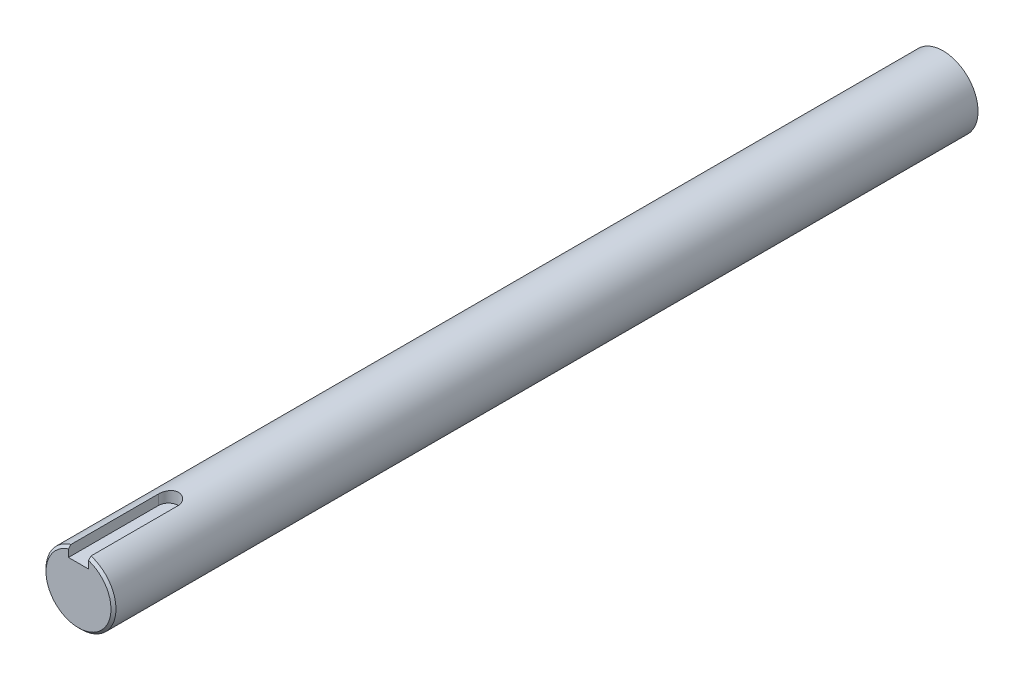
ISO-10303-21;
HEADER;
FILE_DESCRIPTION(('STEP AP214'),'2;1');
FILE_NAME('part.step','',(''),(''),'','','');
FILE_SCHEMA(('AUTOMOTIVE_DESIGN { 1 0 10303 214 1 1 1 1 }'));
ENDSEC;
DATA;
#1=APPLICATION_CONTEXT('core data for automotive mechanical design processes');
#2=APPLICATION_PROTOCOL_DEFINITION('international standard','automotive_design',2000,#1);
#3=PRODUCT_CONTEXT('',#1,'mechanical');
#4=PRODUCT('Part','Part','',(#3));
#5=PRODUCT_RELATED_PRODUCT_CATEGORY('part','',(#4));
#6=PRODUCT_DEFINITION_FORMATION('','',#4);
#7=PRODUCT_DEFINITION_CONTEXT('part definition',#1,'design');
#8=PRODUCT_DEFINITION('design','',#6,#7);
#9=PRODUCT_DEFINITION_SHAPE('','',#8);
#10=(LENGTH_UNIT() NAMED_UNIT(*) SI_UNIT(.MILLI.,.METRE.));
#11=(NAMED_UNIT(*) PLANE_ANGLE_UNIT() SI_UNIT($,.RADIAN.));
#12=(NAMED_UNIT(*) SI_UNIT($,.STERADIAN.) SOLID_ANGLE_UNIT());
#13=UNCERTAINTY_MEASURE_WITH_UNIT(LENGTH_MEASURE(1.E-05),#10,'distance_accuracy_value','');
#14=(GEOMETRIC_REPRESENTATION_CONTEXT(3) GLOBAL_UNCERTAINTY_ASSIGNED_CONTEXT((#13)) GLOBAL_UNIT_ASSIGNED_CONTEXT((#10,
#11,#12)) REPRESENTATION_CONTEXT('',''));
#15=CARTESIAN_POINT('',(0.,0.,0.));
#16=DIRECTION('',(0.,0.,1.));
#17=DIRECTION('',(1.,0.,0.));
#18=AXIS2_PLACEMENT_3D('',#15,#16,#17);
#19=CARTESIAN_POINT('',(0.,0.,98.));
#20=DIRECTION('',(0.,0.,-1.));
#21=DIRECTION('',(-1.,0.,0.));
#22=AXIS2_PLACEMENT_3D('',#19,#20,#21);
#23=CYLINDRICAL_SURFACE('',#22,7.);
#24=DIRECTION('',(0.,0.,-1.));
#25=VECTOR('',#24,1.);
#26=CARTESIAN_POINT('',(2.,6.70820393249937,98.));
#27=LINE('',#26,#25);
#28=CARTESIAN_POINT('',(2.,6.70820393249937,97.5));
#29=VERTEX_POINT('',#28);
#30=CARTESIAN_POINT('',(2.,6.70820393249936,80.));
#31=VERTEX_POINT('',#30);
#32=EDGE_CURVE('E103',#29,#31,#27,.T.);
#33=ORIENTED_EDGE('',*,*,#32,.F.);
#34=CARTESIAN_POINT('',(0.,0.,97.5));
#35=DIRECTION('',(0.,0.,1.));
#36=DIRECTION('',(1.,0.,0.));
#37=AXIS2_PLACEMENT_3D('',#34,#35,#36);
#38=CIRCLE('',#37,7.);
#39=CARTESIAN_POINT('',(-2.,6.70820393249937,97.5));
#40=VERTEX_POINT('',#39);
#41=EDGE_CURVE('E48',#29,#40,#38,.F.);
#42=ORIENTED_EDGE('',*,*,#41,.T.);
#43=DIRECTION('',(0.,0.,-1.));
#44=VECTOR('',#43,1.);
#45=CARTESIAN_POINT('',(-2.,6.70820393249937,98.));
#46=LINE('',#45,#44);
#47=CARTESIAN_POINT('',(-2.,6.70820393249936,80.));
#48=VERTEX_POINT('',#47);
#49=EDGE_CURVE('E114',#40,#48,#46,.T.);
#50=ORIENTED_EDGE('',*,*,#49,.T.);
#51=CARTESIAN_POINT('',(2.,6.70820393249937,80.));
#52=CARTESIAN_POINT('',(2.00000099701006,6.70819953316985,79.9449659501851));
#53=CARTESIAN_POINT('',(1.99772698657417,6.70888204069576,79.8899594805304));
#54=CARTESIAN_POINT('',(1.988664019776,6.71157572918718,79.7803637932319));
#55=CARTESIAN_POINT('',(1.98187599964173,6.71358663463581,79.7257744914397));
#56=CARTESIAN_POINT('',(1.95485062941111,6.72152750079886,79.563492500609));
#57=CARTESIAN_POINT('',(1.92795143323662,6.72936619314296,79.4569243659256));
#58=CARTESIAN_POINT('',(1.85729763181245,6.74920530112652,79.2500599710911));
#59=CARTESIAN_POINT('',(1.81354760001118,6.76120458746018,79.1497620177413));
#60=CARTESIAN_POINT('',(1.7105009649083,6.78800504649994,78.9578633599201));
#61=CARTESIAN_POINT('',(1.65119805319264,6.80280735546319,78.8662662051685));
#62=CARTESIAN_POINT('',(1.51692637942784,6.83401742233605,78.6918092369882));
#63=CARTESIAN_POINT('',(1.44159286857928,6.85045675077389,78.6092358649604));
#64=CARTESIAN_POINT('',(1.27817556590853,6.88281888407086,78.4577009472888));
#65=CARTESIAN_POINT('',(1.19008966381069,6.89874160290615,78.3887416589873));
#66=CARTESIAN_POINT('',(1.00164390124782,6.92863365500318,78.2651698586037));
#67=CARTESIAN_POINT('',(0.901086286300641,6.94256116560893,78.210847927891));
#68=CARTESIAN_POINT('',(0.69180361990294,6.96652585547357,78.1199966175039));
#69=CARTESIAN_POINT('',(0.583080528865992,6.9765639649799,78.0834629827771));
#70=CARTESIAN_POINT('',(0.363559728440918,6.99139511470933,78.0301658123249));
#71=CARTESIAN_POINT('',(0.252890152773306,6.9963181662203,78.0129113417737));
#72=CARTESIAN_POINT('',(0.0301224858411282,7.0008209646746,77.9971132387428));
#73=CARTESIAN_POINT('',(-0.0819753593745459,7.00040161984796,77.9985664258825));
#74=CARTESIAN_POINT('',(-0.300980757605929,6.99436005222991,78.0198064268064));
#75=CARTESIAN_POINT('',(-0.40794465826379,6.98888865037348,78.0390618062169));
#76=CARTESIAN_POINT('',(-0.617053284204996,6.97353876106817,78.0944954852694));
#77=CARTESIAN_POINT('',(-0.719197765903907,6.96366005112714,78.1306746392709));
#78=CARTESIAN_POINT('',(-0.917074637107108,6.94039022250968,78.2193097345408));
#79=CARTESIAN_POINT('',(-1.01272458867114,6.92696183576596,78.2719395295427));
#80=CARTESIAN_POINT('',(-1.19400864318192,6.89802743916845,78.3918457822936));
#81=CARTESIAN_POINT('',(-1.27964070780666,6.88252100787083,78.4591252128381));
#82=CARTESIAN_POINT('',(-1.4416242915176,6.85045847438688,78.6091975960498));
#83=CARTESIAN_POINT('',(-1.51754611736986,6.83388462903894,78.6924510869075));
#84=CARTESIAN_POINT('',(-1.65448071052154,6.8020328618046,78.8706972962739));
#85=CARTESIAN_POINT('',(-1.71548924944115,6.78675530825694,78.9656933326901));
#86=CARTESIAN_POINT('',(-1.82126577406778,6.75914312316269,79.165787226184));
#87=CARTESIAN_POINT('',(-1.86589126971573,6.74683461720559,79.2709641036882));
#88=CARTESIAN_POINT('',(-1.93662306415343,6.72687625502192,79.4877120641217));
#89=CARTESIAN_POINT('',(-1.96275743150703,6.71921934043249,79.5992731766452));
#90=CARTESIAN_POINT('',(-1.98612021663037,6.71232934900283,79.7598794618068));
#91=CARTESIAN_POINT('',(-1.99132502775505,6.71078540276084,79.807779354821));
#92=CARTESIAN_POINT('',(-1.99826154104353,6.7087227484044,79.9037782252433));
#93=CARTESIAN_POINT('',(-1.99999854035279,6.70820247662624,79.9518767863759));
#94=CARTESIAN_POINT('',(-2.,6.70820393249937,80.));
#95=B_SPLINE_CURVE_WITH_KNOTS('',3,(#51,#52,#53,#54,#55,#56,#57,#58,#59,#60,#61,#62,#63,#64,#65,
#66,#67,#68,#69,#70,#71,#72,#73,#74,#75,#76,#77,#78,#79,#80,#81,#82,#83,#84,#85,#86,#87,#88,#89,
#90,#91,#92,#93,#94),.UNSPECIFIED.,.F.,.F.,(4,2,2,2,2,2,2,2,2,2,2,2,2,2,2,2,2,2,2,2,2,4),(0.,
0.164996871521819,0.32995953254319,0.658815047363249,0.987581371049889,1.3164812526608,
1.65386790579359,1.99131045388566,2.33502692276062,2.67866113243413,3.01332990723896,
3.34794178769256,3.67287650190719,3.99782762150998,4.32633613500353,4.65491137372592,
4.99498620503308,5.33515734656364,5.67822068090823,6.0207621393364,6.16526974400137,
6.30955644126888),.UNSPECIFIED.);
#96=EDGE_CURVE('E97',#31,#48,#95,.T.);
#97=ORIENTED_EDGE('',*,*,#96,.F.);
#98=EDGE_LOOP('',(#33,#42,#50,#97));
#99=FACE_BOUND('',#98,.T.);
#100=CARTESIAN_POINT('',(0.,0.,-75.));
#101=DIRECTION('',(0.,0.,-1.));
#102=DIRECTION('',(-1.,0.,0.));
#103=AXIS2_PLACEMENT_3D('',#100,#101,#102);
#104=CIRCLE('',#103,7.);
#105=CARTESIAN_POINT('',(-7.,0.,-75.));
#106=VERTEX_POINT('',#105);
#107=EDGE_CURVE('E98',#106,#106,#104,.T.);
#108=ORIENTED_EDGE('',*,*,#107,.F.);
#109=EDGE_LOOP('',(#108));
#110=FACE_BOUND('',#109,.T.);
#111=ADVANCED_FACE('F35',(#99,#110),#23,.T.);
#112=CARTESIAN_POINT('',(2.,4.7,98.));
#113=DIRECTION('',(1.,0.,0.));
#114=DIRECTION('',(0.,1.,0.));
#115=AXIS2_PLACEMENT_3D('',#112,#113,#114);
#116=PLANE('',#115);
#117=DIRECTION('',(0.,-1.,0.));
#118=VECTOR('',#117,1.);
#119=CARTESIAN_POINT('',(2.,4.7,98.));
#120=LINE('',#119,#118);
#121=CARTESIAN_POINT('',(2.,6.18465843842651,98.));
#122=VERTEX_POINT('',#121);
#123=CARTESIAN_POINT('',(2.,4.7,98.));
#124=VERTEX_POINT('',#123);
#125=EDGE_CURVE('E104',#122,#124,#120,.T.);
#126=ORIENTED_EDGE('',*,*,#125,.F.);
#127=CARTESIAN_POINT('',(2.,6.18465843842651,98.));
#128=CARTESIAN_POINT('',(2.,6.27206463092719,97.9168222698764));
#129=CARTESIAN_POINT('',(2.,6.35939651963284,97.8335667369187));
#130=CARTESIAN_POINT('',(2.,6.53391168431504,97.6669000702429));
#131=CARTESIAN_POINT('',(2.,6.62109496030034,97.583488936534));
#132=CARTESIAN_POINT('',(2.,6.70820393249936,97.5));
#133=B_SPLINE_CURVE_WITH_KNOTS('',3,(#127,#128,#129,#130,#131,#132),.UNSPECIFIED.,.F.,.F.,(4,2,
4),(0.,0.361973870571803,0.723947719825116),.UNSPECIFIED.);
#134=EDGE_CURVE('E62',#122,#29,#133,.T.);
#135=ORIENTED_EDGE('',*,*,#134,.T.);
#136=ORIENTED_EDGE('',*,*,#32,.T.);
#137=DIRECTION('',(0.,1.,0.));
#138=VECTOR('',#137,1.);
#139=CARTESIAN_POINT('',(2.,4.7,80.));
#140=LINE('',#139,#138);
#141=CARTESIAN_POINT('',(2.,4.7,80.));
#142=VERTEX_POINT('',#141);
#143=EDGE_CURVE('E89',#142,#31,#140,.T.);
#144=ORIENTED_EDGE('',*,*,#143,.F.);
#145=DIRECTION('',(0.,0.,-1.));
#146=VECTOR('',#145,1.);
#147=CARTESIAN_POINT('',(2.,4.7,98.));
#148=LINE('',#147,#146);
#149=EDGE_CURVE('E102',#124,#142,#148,.T.);
#150=ORIENTED_EDGE('',*,*,#149,.F.);
#151=EDGE_LOOP('',(#126,#135,#136,#144,#150));
#152=FACE_BOUND('',#151,.T.);
#153=ADVANCED_FACE('F101',(#152),#116,.F.);
#154=CARTESIAN_POINT('',(2.,4.7,98.));
#155=DIRECTION('',(0.,-1.,0.));
#156=DIRECTION('',(1.,0.,0.));
#157=AXIS2_PLACEMENT_3D('',#154,#155,#156);
#158=PLANE('',#157);
#159=ORIENTED_EDGE('',*,*,#149,.T.);
#160=CARTESIAN_POINT('',(0.,4.7,80.));
#161=DIRECTION('',(0.,1.,0.));
#162=DIRECTION('',(-1.,0.,0.));
#163=AXIS2_PLACEMENT_3D('',#160,#161,#162);
#164=CIRCLE('',#163,2.);
#165=CARTESIAN_POINT('',(-2.,4.7,80.));
#166=VERTEX_POINT('',#165);
#167=EDGE_CURVE('E85',#142,#166,#164,.T.);
#168=ORIENTED_EDGE('',*,*,#167,.T.);
#169=DIRECTION('',(0.,0.,-1.));
#170=VECTOR('',#169,1.);
#171=CARTESIAN_POINT('',(-2.,4.7,98.));
#172=LINE('',#171,#170);
#173=CARTESIAN_POINT('',(-2.,4.7,98.));
#174=VERTEX_POINT('',#173);
#175=EDGE_CURVE('E110',#174,#166,#172,.T.);
#176=ORIENTED_EDGE('',*,*,#175,.F.);
#177=DIRECTION('',(-1.,0.,0.));
#178=VECTOR('',#177,1.);
#179=CARTESIAN_POINT('',(2.,4.7,98.));
#180=LINE('',#179,#178);
#181=EDGE_CURVE('E108',#124,#174,#180,.T.);
#182=ORIENTED_EDGE('',*,*,#181,.F.);
#183=EDGE_LOOP('',(#159,#168,#176,#182));
#184=FACE_BOUND('',#183,.T.);
#185=ADVANCED_FACE('F107',(#184),#158,.F.);
#186=CARTESIAN_POINT('',(-2.,4.7,98.));
#187=DIRECTION('',(-1.,0.,0.));
#188=DIRECTION('',(0.,0.,1.));
#189=AXIS2_PLACEMENT_3D('',#186,#187,#188);
#190=PLANE('',#189);
#191=ORIENTED_EDGE('',*,*,#49,.F.);
#192=CARTESIAN_POINT('',(-2.,6.70820393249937,97.5));
#193=CARTESIAN_POINT('',(-2.,6.62109496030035,97.583488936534));
#194=CARTESIAN_POINT('',(-2.,6.53391168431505,97.6669000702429));
#195=CARTESIAN_POINT('',(-2.,6.35939651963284,97.8335667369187));
#196=CARTESIAN_POINT('',(-2.,6.27206463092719,97.9168222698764));
#197=CARTESIAN_POINT('',(-2.,6.18465843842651,98.));
#198=B_SPLINE_CURVE_WITH_KNOTS('',3,(#192,#193,#194,#195,#196,#197),.UNSPECIFIED.,.F.,.F.,(4,2,
4),(0.,0.361973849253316,0.723947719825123),.UNSPECIFIED.);
#199=CARTESIAN_POINT('',(-2.,6.18465843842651,98.));
#200=VERTEX_POINT('',#199);
#201=EDGE_CURVE('E11',#40,#200,#198,.T.);
#202=ORIENTED_EDGE('',*,*,#201,.T.);
#203=DIRECTION('',(0.,1.,0.));
#204=VECTOR('',#203,1.);
#205=CARTESIAN_POINT('',(-2.,4.7,98.));
#206=LINE('',#205,#204);
#207=EDGE_CURVE('E160',#174,#200,#206,.T.);
#208=ORIENTED_EDGE('',*,*,#207,.F.);
#209=ORIENTED_EDGE('',*,*,#175,.T.);
#210=DIRECTION('',(0.,-1.,0.));
#211=VECTOR('',#210,1.);
#212=CARTESIAN_POINT('',(-2.,4.7,80.));
#213=LINE('',#212,#211);
#214=EDGE_CURVE('E92',#48,#166,#213,.T.);
#215=ORIENTED_EDGE('',*,*,#214,.F.);
#216=EDGE_LOOP('',(#191,#202,#208,#209,#215));
#217=FACE_BOUND('',#216,.T.);
#218=ADVANCED_FACE('F125',(#217),#190,.F.);
#219=CARTESIAN_POINT('',(0.,0.,98.));
#220=DIRECTION('',(0.,0.,1.));
#221=DIRECTION('',(1.,0.,0.));
#222=AXIS2_PLACEMENT_3D('',#219,#220,#221);
#223=PLANE('',#222);
#224=ORIENTED_EDGE('',*,*,#207,.T.);
#225=CARTESIAN_POINT('',(0.,0.,98.));
#226=DIRECTION('',(0.,0.,1.));
#227=DIRECTION('',(1.,0.,0.));
#228=AXIS2_PLACEMENT_3D('',#225,#226,#227);
#229=CIRCLE('',#228,6.50000000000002);
#230=EDGE_CURVE('E109',#200,#122,#229,.T.);
#231=ORIENTED_EDGE('',*,*,#230,.T.);
#232=ORIENTED_EDGE('',*,*,#125,.T.);
#233=ORIENTED_EDGE('',*,*,#181,.T.);
#234=EDGE_LOOP('',(#224,#231,#232,#233));
#235=FACE_BOUND('',#234,.T.);
#236=ADVANCED_FACE('F129',(#235),#223,.T.);
#237=CARTESIAN_POINT('',(0.,84.7,80.));
#238=DIRECTION('',(0.,-1.,0.));
#239=DIRECTION('',(1.,0.,0.));
#240=AXIS2_PLACEMENT_3D('',#237,#238,#239);
#241=CYLINDRICAL_SURFACE('',#240,2.);
#242=ORIENTED_EDGE('',*,*,#96,.T.);
#243=ORIENTED_EDGE('',*,*,#214,.T.);
#244=ORIENTED_EDGE('',*,*,#167,.F.);
#245=ORIENTED_EDGE('',*,*,#143,.T.);
#246=EDGE_LOOP('',(#242,#243,#244,#245));
#247=FACE_BOUND('',#246,.T.);
#248=ADVANCED_FACE('F88',(#247),#241,.F.);
#249=CARTESIAN_POINT('',(0.,0.,98.));
#250=DIRECTION('',(0.,0.,-1.));
#251=DIRECTION('',(-1.,0.,0.));
#252=AXIS2_PLACEMENT_3D('',#249,#250,#251);
#253=CONICAL_SURFACE('',#252,6.50000000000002,0.785398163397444);
#254=ORIENTED_EDGE('',*,*,#201,.F.);
#255=ORIENTED_EDGE('',*,*,#41,.F.);
#256=ORIENTED_EDGE('',*,*,#134,.F.);
#257=ORIENTED_EDGE('',*,*,#230,.F.);
#258=EDGE_LOOP('',(#254,#255,#256,#257));
#259=FACE_BOUND('',#258,.T.);
#260=ADVANCED_FACE('F37',(#259),#253,.T.);
#261=CARTESIAN_POINT('',(0.,0.,-75.));
#262=DIRECTION('',(0.,0.,-1.));
#263=DIRECTION('',(-1.,0.,0.));
#264=AXIS2_PLACEMENT_3D('',#261,#262,#263);
#265=PLANE('',#264);
#266=ORIENTED_EDGE('',*,*,#107,.T.);
#267=EDGE_LOOP('',(#266));
#268=FACE_BOUND('',#267,.T.);
#269=ADVANCED_FACE('F144',(#268),#265,.T.);
#270=CLOSED_SHELL('',(#111,#153,#185,#218,#236,#248,#260,#269));
#271=MANIFOLD_SOLID_BREP('B2',#270);
#272=ADVANCED_BREP_SHAPE_REPRESENTATION('',(#18,#271),#14);
#273=SHAPE_DEFINITION_REPRESENTATION(#9,#272);
ENDSEC;
END-ISO-10303-21;
